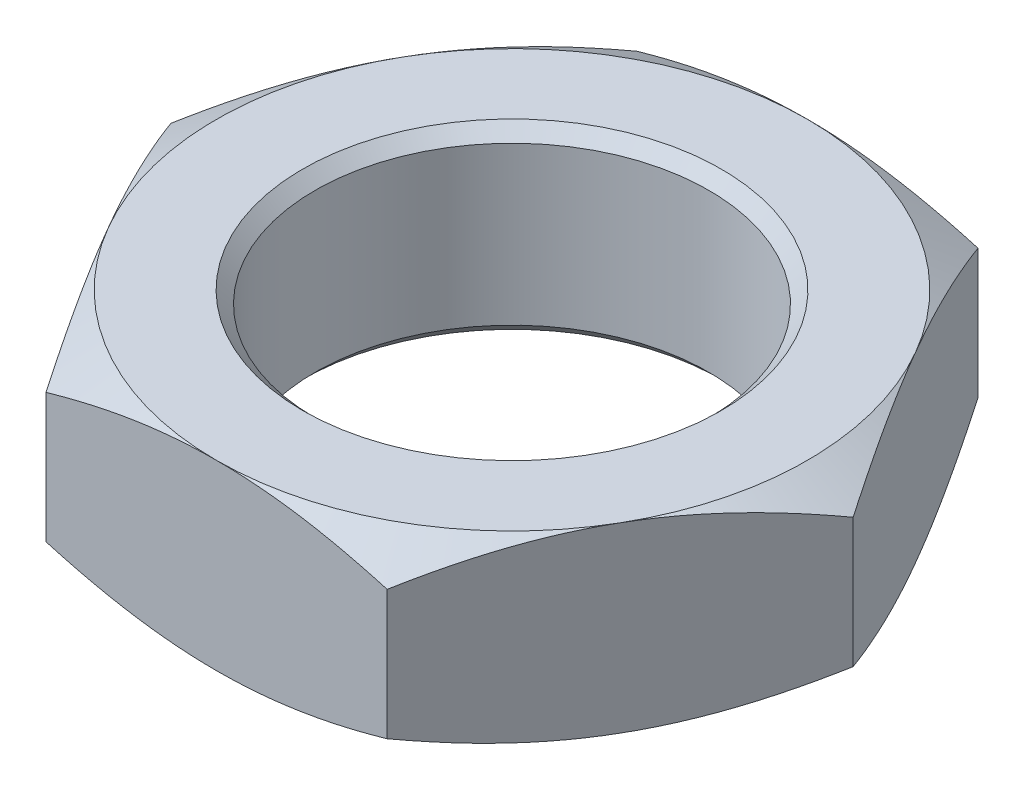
from build123d import *

# Parameters (mm, degrees)
SKETCH1_R           = 8
BOSS_EXTRUDE1_DEPTH = 3.7
CHAMFER1_SIZE       = 0.5


with BuildPart() as part:
    # Sketch1 → Boss-Extrude1 (new, symmetric)
    with BuildSketch(Plane(origin=(0, 0, 0), x_dir=(1, 0, 0), z_dir=(0, 1, 0))):
        Polygon((6.92820323, 12), (-6.92820323, 12), (-13.856406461, 0), (-6.92820323, -12), (6.92820323, -12), (13.856406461, 0), align=None)
        with Locations(Location((0, 0, 0), (0, 0, 270))):
            Circle(SKETCH1_R, mode=Mode.SUBTRACT)
    extrude(amount=BOSS_EXTRUDE1_DEPTH, both=True)

    # Sketch2 → Cut-Revolve1 (revolve, cut)
    with BuildSketch(Plane(origin=(0, 0, 0), x_dir=(0, 0, -1), z_dir=(1, 0, 0))):
        Polygon((12, 3.7), (22.392304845, 3.7), (22.392304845, -2.3), align=None)
        Polygon((-12, -3.7), (-22.392304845, -3.7), (-22.392304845, 2.3), align=None)
    revolve(axis=Axis((0, 3.7, 0), (0, -1, 0)), mode=Mode.SUBTRACT)

    # Chamfer1
    chamfer1_edges = [part.edges().sort_by_distance(p)[0] for p in [
        (0, -3.7, -8),
        (0, 3.7, -8),
    ]]
    chamfer(chamfer1_edges, length=CHAMFER1_SIZE)


solid = part.part
